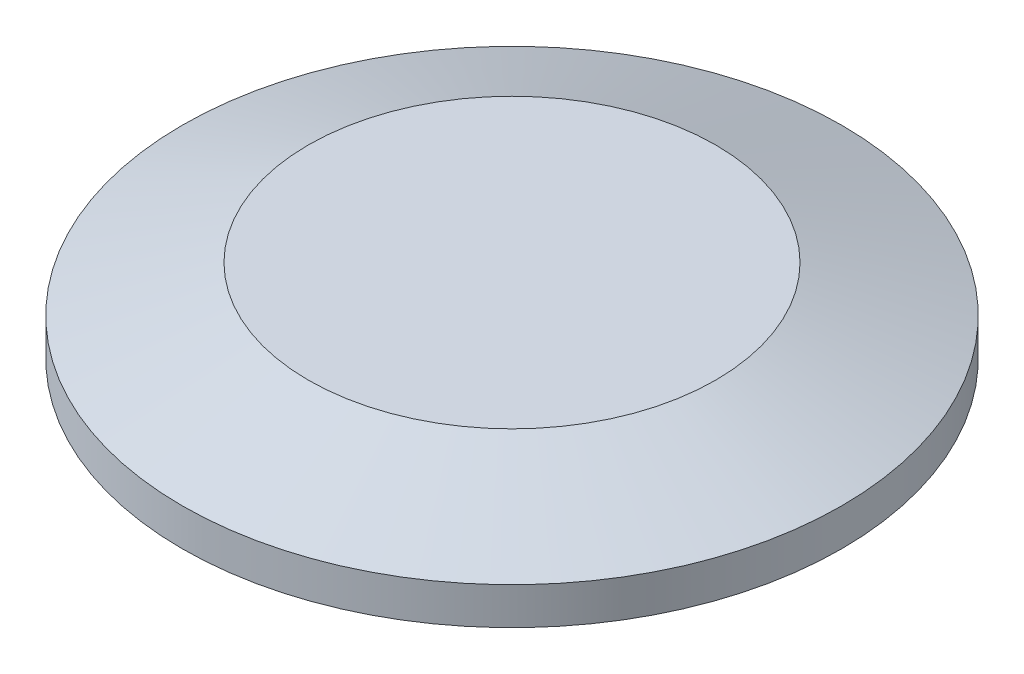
from build123d import *


with BuildPart() as part:
    # Sketch1 → Revolve1 (revolve)
    with BuildSketch(Plane.XY):
        with BuildLine():
            Line((0, 0), (-20.000591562, 0))
            ThreePointArc((-20.000591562, 0), (-20.432788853, 0.129217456), (-20.723133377, 0.474458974))
            ThreePointArc((-20.723133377, 0.474458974), (-21.8186, 1.1938), (-22.914066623, 0.474458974))
            ThreePointArc((-22.914066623, 0.474458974), (-23.204411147, 0.129217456), (-23.636608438, 0))
            Line((-23.636608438, 0), (-25.1968, 0))
            Line((-25.1968, 0), (-25.1968, 2.8448))
            Line((-25.1968, 2.8448), (-15.566342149, 6.35))
            Line((-15.566342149, 6.35), (0, 6.35))
            Line((0, 6.35), (0, 0))
        make_face()
    revolve(axis=Axis((0, 6.35, 0), (0, -1, 0)))


solid = part.part
